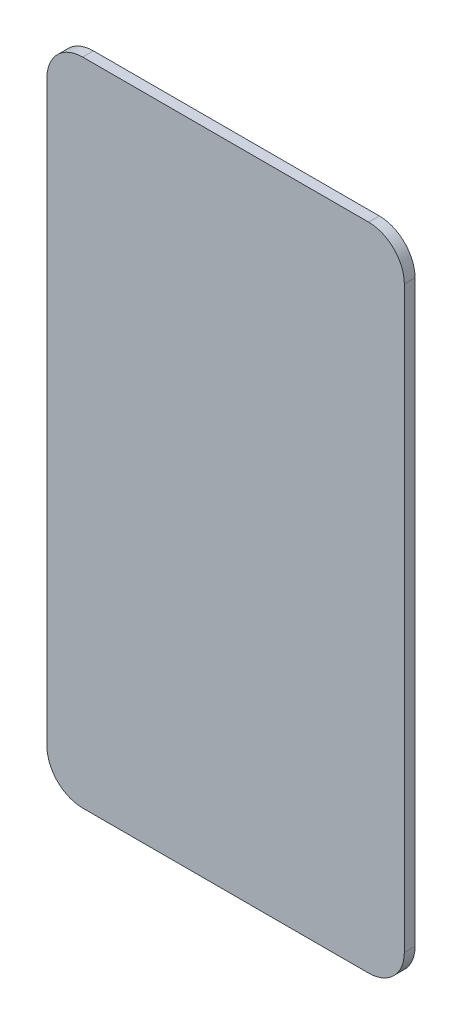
ISO-10303-21;
HEADER;
FILE_DESCRIPTION(('STEP AP214'),'2;1');
FILE_NAME('part.step','',(''),(''),'','','');
FILE_SCHEMA(('AUTOMOTIVE_DESIGN { 1 0 10303 214 1 1 1 1 }'));
ENDSEC;
DATA;
#1=APPLICATION_CONTEXT('core data for automotive mechanical design processes');
#2=APPLICATION_PROTOCOL_DEFINITION('international standard','automotive_design',2000,#1);
#3=PRODUCT_CONTEXT('',#1,'mechanical');
#4=PRODUCT('Part','Part','',(#3));
#5=PRODUCT_RELATED_PRODUCT_CATEGORY('part','',(#4));
#6=PRODUCT_DEFINITION_FORMATION('','',#4);
#7=PRODUCT_DEFINITION_CONTEXT('part definition',#1,'design');
#8=PRODUCT_DEFINITION('design','',#6,#7);
#9=PRODUCT_DEFINITION_SHAPE('','',#8);
#10=(LENGTH_UNIT() NAMED_UNIT(*) SI_UNIT(.MILLI.,.METRE.));
#11=(NAMED_UNIT(*) PLANE_ANGLE_UNIT() SI_UNIT($,.RADIAN.));
#12=(NAMED_UNIT(*) SI_UNIT($,.STERADIAN.) SOLID_ANGLE_UNIT());
#13=UNCERTAINTY_MEASURE_WITH_UNIT(LENGTH_MEASURE(1.E-05),#10,'distance_accuracy_value','');
#14=(GEOMETRIC_REPRESENTATION_CONTEXT(3) GLOBAL_UNCERTAINTY_ASSIGNED_CONTEXT((#13)) GLOBAL_UNIT_ASSIGNED_CONTEXT((#10,
#11,#12)) REPRESENTATION_CONTEXT('',''));
#15=CARTESIAN_POINT('',(0.,0.,0.));
#16=DIRECTION('',(0.,0.,1.));
#17=DIRECTION('',(1.,0.,0.));
#18=AXIS2_PLACEMENT_3D('',#15,#16,#17);
#19=CARTESIAN_POINT('',(-40.,81.,3.));
#20=DIRECTION('',(0.,0.,-1.));
#21=DIRECTION('',(-1.,0.,0.));
#22=AXIS2_PLACEMENT_3D('',#19,#20,#21);
#23=CYLINDRICAL_SURFACE('',#22,9.99999999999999);
#24=CARTESIAN_POINT('',(-40.,81.,0.));
#25=DIRECTION('',(0.,0.,1.));
#26=DIRECTION('',(1.,0.,0.));
#27=AXIS2_PLACEMENT_3D('',#24,#25,#26);
#28=CIRCLE('',#27,9.99999999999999);
#29=CARTESIAN_POINT('',(-39.9999999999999,91.,0.));
#30=VERTEX_POINT('',#29);
#31=CARTESIAN_POINT('',(-50.,80.9999999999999,0.));
#32=VERTEX_POINT('',#31);
#33=EDGE_CURVE('E98',#30,#32,#28,.T.);
#34=ORIENTED_EDGE('',*,*,#33,.T.);
#35=DIRECTION('',(0.,0.,-1.));
#36=VECTOR('',#35,1.);
#37=CARTESIAN_POINT('',(-50.,80.9999999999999,3.));
#38=LINE('',#37,#36);
#39=CARTESIAN_POINT('',(-50.,80.9999999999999,3.));
#40=VERTEX_POINT('',#39);
#41=EDGE_CURVE('E11',#40,#32,#38,.T.);
#42=ORIENTED_EDGE('',*,*,#41,.F.);
#43=CARTESIAN_POINT('',(-40.,81.,3.));
#44=DIRECTION('',(0.,0.,1.));
#45=DIRECTION('',(1.,0.,0.));
#46=AXIS2_PLACEMENT_3D('',#43,#44,#45);
#47=CIRCLE('',#46,9.99999999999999);
#48=CARTESIAN_POINT('',(-39.9999999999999,91.,3.));
#49=VERTEX_POINT('',#48);
#50=EDGE_CURVE('E125',#49,#40,#47,.T.);
#51=ORIENTED_EDGE('',*,*,#50,.F.);
#52=DIRECTION('',(0.,0.,-1.));
#53=VECTOR('',#52,1.);
#54=CARTESIAN_POINT('',(-39.9999999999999,91.,3.));
#55=LINE('',#54,#53);
#56=EDGE_CURVE('E111',#49,#30,#55,.T.);
#57=ORIENTED_EDGE('',*,*,#56,.T.);
#58=EDGE_LOOP('',(#34,#42,#51,#57));
#59=FACE_BOUND('',#58,.T.);
#60=ADVANCED_FACE('F30',(#59),#23,.T.);
#61=CARTESIAN_POINT('',(-50.,80.9999999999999,3.));
#62=DIRECTION('',(1.,0.,0.));
#63=DIRECTION('',(0.,0.,-1.));
#64=AXIS2_PLACEMENT_3D('',#61,#62,#63);
#65=PLANE('',#64);
#66=DIRECTION('',(0.,-1.,0.));
#67=VECTOR('',#66,1.);
#68=CARTESIAN_POINT('',(-50.,80.9999999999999,0.));
#69=LINE('',#68,#67);
#70=CARTESIAN_POINT('',(-50.,-80.9999999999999,0.));
#71=VERTEX_POINT('',#70);
#72=EDGE_CURVE('E94',#32,#71,#69,.T.);
#73=ORIENTED_EDGE('',*,*,#72,.T.);
#74=DIRECTION('',(0.,0.,-1.));
#75=VECTOR('',#74,1.);
#76=CARTESIAN_POINT('',(-50.,-80.9999999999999,3.));
#77=LINE('',#76,#75);
#78=CARTESIAN_POINT('',(-50.,-80.9999999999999,3.));
#79=VERTEX_POINT('',#78);
#80=EDGE_CURVE('E37',#79,#71,#77,.T.);
#81=ORIENTED_EDGE('',*,*,#80,.F.);
#82=DIRECTION('',(0.,-1.,0.));
#83=VECTOR('',#82,1.);
#84=CARTESIAN_POINT('',(-50.,80.9999999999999,3.));
#85=LINE('',#84,#83);
#86=EDGE_CURVE('E107',#40,#79,#85,.T.);
#87=ORIENTED_EDGE('',*,*,#86,.F.);
#88=ORIENTED_EDGE('',*,*,#41,.T.);
#89=EDGE_LOOP('',(#73,#81,#87,#88));
#90=FACE_BOUND('',#89,.T.);
#91=ADVANCED_FACE('F106',(#90),#65,.F.);
#92=CARTESIAN_POINT('',(-40.,-81.,3.));
#93=DIRECTION('',(0.,0.,-1.));
#94=DIRECTION('',(-1.,0.,0.));
#95=AXIS2_PLACEMENT_3D('',#92,#93,#94);
#96=CYLINDRICAL_SURFACE('',#95,9.99999999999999);
#97=CARTESIAN_POINT('',(-40.,-81.,0.));
#98=DIRECTION('',(0.,0.,1.));
#99=DIRECTION('',(-1.,0.,0.));
#100=AXIS2_PLACEMENT_3D('',#97,#98,#99);
#101=CIRCLE('',#100,9.99999999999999);
#102=CARTESIAN_POINT('',(-39.9999999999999,-91.,0.));
#103=VERTEX_POINT('',#102);
#104=EDGE_CURVE('E100',#71,#103,#101,.T.);
#105=ORIENTED_EDGE('',*,*,#104,.T.);
#106=DIRECTION('',(0.,0.,-1.));
#107=VECTOR('',#106,1.);
#108=CARTESIAN_POINT('',(-39.9999999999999,-91.,3.));
#109=LINE('',#108,#107);
#110=CARTESIAN_POINT('',(-39.9999999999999,-91.,3.));
#111=VERTEX_POINT('',#110);
#112=EDGE_CURVE('E151',#111,#103,#109,.T.);
#113=ORIENTED_EDGE('',*,*,#112,.F.);
#114=CARTESIAN_POINT('',(-40.,-81.,3.));
#115=DIRECTION('',(0.,0.,1.));
#116=DIRECTION('',(-1.,0.,0.));
#117=AXIS2_PLACEMENT_3D('',#114,#115,#116);
#118=CIRCLE('',#117,9.99999999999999);
#119=EDGE_CURVE('E128',#79,#111,#118,.T.);
#120=ORIENTED_EDGE('',*,*,#119,.F.);
#121=ORIENTED_EDGE('',*,*,#80,.T.);
#122=EDGE_LOOP('',(#105,#113,#120,#121));
#123=FACE_BOUND('',#122,.T.);
#124=ADVANCED_FACE('F155',(#123),#96,.T.);
#125=CARTESIAN_POINT('',(-39.9999999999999,-91.,3.));
#126=DIRECTION('',(0.,1.,0.));
#127=DIRECTION('',(0.,0.,1.));
#128=AXIS2_PLACEMENT_3D('',#125,#126,#127);
#129=PLANE('',#128);
#130=DIRECTION('',(1.,0.,0.));
#131=VECTOR('',#130,1.);
#132=CARTESIAN_POINT('',(-39.9999999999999,-91.,0.));
#133=LINE('',#132,#131);
#134=CARTESIAN_POINT('',(39.9999999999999,-91.,0.));
#135=VERTEX_POINT('',#134);
#136=EDGE_CURVE('E115',#103,#135,#133,.T.);
#137=ORIENTED_EDGE('',*,*,#136,.T.);
#138=DIRECTION('',(0.,0.,-1.));
#139=VECTOR('',#138,1.);
#140=CARTESIAN_POINT('',(39.9999999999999,-91.,3.));
#141=LINE('',#140,#139);
#142=CARTESIAN_POINT('',(39.9999999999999,-91.,3.));
#143=VERTEX_POINT('',#142);
#144=EDGE_CURVE('E148',#143,#135,#141,.T.);
#145=ORIENTED_EDGE('',*,*,#144,.F.);
#146=DIRECTION('',(1.,0.,0.));
#147=VECTOR('',#146,1.);
#148=CARTESIAN_POINT('',(-39.9999999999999,-91.,3.));
#149=LINE('',#148,#147);
#150=EDGE_CURVE('E130',#111,#143,#149,.T.);
#151=ORIENTED_EDGE('',*,*,#150,.F.);
#152=ORIENTED_EDGE('',*,*,#112,.T.);
#153=EDGE_LOOP('',(#137,#145,#151,#152));
#154=FACE_BOUND('',#153,.T.);
#155=ADVANCED_FACE('F163',(#154),#129,.F.);
#156=CARTESIAN_POINT('',(40.,-81.,3.));
#157=DIRECTION('',(0.,0.,-1.));
#158=DIRECTION('',(-1.,0.,0.));
#159=AXIS2_PLACEMENT_3D('',#156,#157,#158);
#160=CYLINDRICAL_SURFACE('',#159,9.99999999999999);
#161=CARTESIAN_POINT('',(40.,-81.,0.));
#162=DIRECTION('',(0.,0.,1.));
#163=DIRECTION('',(1.,0.,0.));
#164=AXIS2_PLACEMENT_3D('',#161,#162,#163);
#165=CIRCLE('',#164,9.99999999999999);
#166=CARTESIAN_POINT('',(50.,-80.9999999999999,0.));
#167=VERTEX_POINT('',#166);
#168=EDGE_CURVE('E117',#135,#167,#165,.T.);
#169=ORIENTED_EDGE('',*,*,#168,.T.);
#170=DIRECTION('',(0.,0.,-1.));
#171=VECTOR('',#170,1.);
#172=CARTESIAN_POINT('',(50.,-80.9999999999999,3.));
#173=LINE('',#172,#171);
#174=CARTESIAN_POINT('',(50.,-80.9999999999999,3.));
#175=VERTEX_POINT('',#174);
#176=EDGE_CURVE('E145',#175,#167,#173,.T.);
#177=ORIENTED_EDGE('',*,*,#176,.F.);
#178=CARTESIAN_POINT('',(40.,-81.,3.));
#179=DIRECTION('',(0.,0.,1.));
#180=DIRECTION('',(1.,0.,0.));
#181=AXIS2_PLACEMENT_3D('',#178,#179,#180);
#182=CIRCLE('',#181,9.99999999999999);
#183=EDGE_CURVE('E132',#143,#175,#182,.T.);
#184=ORIENTED_EDGE('',*,*,#183,.F.);
#185=ORIENTED_EDGE('',*,*,#144,.T.);
#186=EDGE_LOOP('',(#169,#177,#184,#185));
#187=FACE_BOUND('',#186,.T.);
#188=ADVANCED_FACE('F166',(#187),#160,.T.);
#189=CARTESIAN_POINT('',(50.,80.9999999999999,3.));
#190=DIRECTION('',(-1.,0.,0.));
#191=DIRECTION('',(0.,0.,1.));
#192=AXIS2_PLACEMENT_3D('',#189,#190,#191);
#193=PLANE('',#192);
#194=DIRECTION('',(0.,1.,0.));
#195=VECTOR('',#194,1.);
#196=CARTESIAN_POINT('',(50.,80.9999999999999,0.));
#197=LINE('',#196,#195);
#198=CARTESIAN_POINT('',(50.,80.9999999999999,0.));
#199=VERTEX_POINT('',#198);
#200=EDGE_CURVE('E119',#167,#199,#197,.T.);
#201=ORIENTED_EDGE('',*,*,#200,.T.);
#202=DIRECTION('',(0.,0.,-1.));
#203=VECTOR('',#202,1.);
#204=CARTESIAN_POINT('',(50.,80.9999999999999,3.));
#205=LINE('',#204,#203);
#206=CARTESIAN_POINT('',(50.,80.9999999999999,3.));
#207=VERTEX_POINT('',#206);
#208=EDGE_CURVE('E142',#207,#199,#205,.T.);
#209=ORIENTED_EDGE('',*,*,#208,.F.);
#210=DIRECTION('',(0.,1.,0.));
#211=VECTOR('',#210,1.);
#212=CARTESIAN_POINT('',(50.,80.9999999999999,3.));
#213=LINE('',#212,#211);
#214=EDGE_CURVE('E134',#175,#207,#213,.T.);
#215=ORIENTED_EDGE('',*,*,#214,.F.);
#216=ORIENTED_EDGE('',*,*,#176,.T.);
#217=EDGE_LOOP('',(#201,#209,#215,#216));
#218=FACE_BOUND('',#217,.T.);
#219=ADVANCED_FACE('F171',(#218),#193,.F.);
#220=CARTESIAN_POINT('',(40.,81.,3.));
#221=DIRECTION('',(0.,0.,-1.));
#222=DIRECTION('',(-1.,0.,0.));
#223=AXIS2_PLACEMENT_3D('',#220,#221,#222);
#224=CYLINDRICAL_SURFACE('',#223,9.99999999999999);
#225=CARTESIAN_POINT('',(40.,81.,0.));
#226=DIRECTION('',(0.,0.,1.));
#227=DIRECTION('',(1.,0.,0.));
#228=AXIS2_PLACEMENT_3D('',#225,#226,#227);
#229=CIRCLE('',#228,9.99999999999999);
#230=CARTESIAN_POINT('',(39.9999999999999,91.,0.));
#231=VERTEX_POINT('',#230);
#232=EDGE_CURVE('E121',#199,#231,#229,.T.);
#233=ORIENTED_EDGE('',*,*,#232,.T.);
#234=DIRECTION('',(0.,0.,-1.));
#235=VECTOR('',#234,1.);
#236=CARTESIAN_POINT('',(39.9999999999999,91.,3.));
#237=LINE('',#236,#235);
#238=CARTESIAN_POINT('',(39.9999999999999,91.,3.));
#239=VERTEX_POINT('',#238);
#240=EDGE_CURVE('E139',#239,#231,#237,.T.);
#241=ORIENTED_EDGE('',*,*,#240,.F.);
#242=CARTESIAN_POINT('',(40.,81.,3.));
#243=DIRECTION('',(0.,0.,1.));
#244=DIRECTION('',(1.,0.,0.));
#245=AXIS2_PLACEMENT_3D('',#242,#243,#244);
#246=CIRCLE('',#245,9.99999999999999);
#247=EDGE_CURVE('E49',#207,#239,#246,.T.);
#248=ORIENTED_EDGE('',*,*,#247,.F.);
#249=ORIENTED_EDGE('',*,*,#208,.T.);
#250=EDGE_LOOP('',(#233,#241,#248,#249));
#251=FACE_BOUND('',#250,.T.);
#252=ADVANCED_FACE('F174',(#251),#224,.T.);
#253=CARTESIAN_POINT('',(-39.9999999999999,91.,3.));
#254=DIRECTION('',(0.,-1.,0.));
#255=DIRECTION('',(0.,0.,-1.));
#256=AXIS2_PLACEMENT_3D('',#253,#254,#255);
#257=PLANE('',#256);
#258=DIRECTION('',(-1.,0.,0.));
#259=VECTOR('',#258,1.);
#260=CARTESIAN_POINT('',(-39.9999999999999,91.,0.));
#261=LINE('',#260,#259);
#262=EDGE_CURVE('E123',#231,#30,#261,.T.);
#263=ORIENTED_EDGE('',*,*,#262,.T.);
#264=ORIENTED_EDGE('',*,*,#56,.F.);
#265=DIRECTION('',(-1.,0.,0.));
#266=VECTOR('',#265,1.);
#267=CARTESIAN_POINT('',(-39.9999999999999,91.,3.));
#268=LINE('',#267,#266);
#269=EDGE_CURVE('E44',#239,#49,#268,.T.);
#270=ORIENTED_EDGE('',*,*,#269,.F.);
#271=ORIENTED_EDGE('',*,*,#240,.T.);
#272=EDGE_LOOP('',(#263,#264,#270,#271));
#273=FACE_BOUND('',#272,.T.);
#274=ADVANCED_FACE('F176',(#273),#257,.F.);
#275=CARTESIAN_POINT('',(-40.,81.,3.));
#276=DIRECTION('',(0.,0.,1.));
#277=DIRECTION('',(1.,0.,0.));
#278=AXIS2_PLACEMENT_3D('',#275,#276,#277);
#279=PLANE('',#278);
#280=ORIENTED_EDGE('',*,*,#50,.T.);
#281=ORIENTED_EDGE('',*,*,#86,.T.);
#282=ORIENTED_EDGE('',*,*,#119,.T.);
#283=ORIENTED_EDGE('',*,*,#150,.T.);
#284=ORIENTED_EDGE('',*,*,#183,.T.);
#285=ORIENTED_EDGE('',*,*,#214,.T.);
#286=ORIENTED_EDGE('',*,*,#247,.T.);
#287=ORIENTED_EDGE('',*,*,#269,.T.);
#288=EDGE_LOOP('',(#280,#281,#282,#283,#284,#285,#286,#287));
#289=FACE_BOUND('',#288,.T.);
#290=ADVANCED_FACE('F158',(#289),#279,.T.);
#291=CARTESIAN_POINT('',(-40.,81.,0.));
#292=DIRECTION('',(0.,0.,1.));
#293=DIRECTION('',(1.,0.,0.));
#294=AXIS2_PLACEMENT_3D('',#291,#292,#293);
#295=PLANE('',#294);
#296=ORIENTED_EDGE('',*,*,#33,.F.);
#297=ORIENTED_EDGE('',*,*,#262,.F.);
#298=ORIENTED_EDGE('',*,*,#232,.F.);
#299=ORIENTED_EDGE('',*,*,#200,.F.);
#300=ORIENTED_EDGE('',*,*,#168,.F.);
#301=ORIENTED_EDGE('',*,*,#136,.F.);
#302=ORIENTED_EDGE('',*,*,#104,.F.);
#303=ORIENTED_EDGE('',*,*,#72,.F.);
#304=EDGE_LOOP('',(#296,#297,#298,#299,#300,#301,#302,#303));
#305=FACE_BOUND('',#304,.T.);
#306=ADVANCED_FACE('F95',(#305),#295,.F.);
#307=CLOSED_SHELL('',(#60,#91,#124,#155,#188,#219,#252,#274,#290,#306));
#308=MANIFOLD_SOLID_BREP('B2',#307);
#309=ADVANCED_BREP_SHAPE_REPRESENTATION('',(#18,#308),#14);
#310=SHAPE_DEFINITION_REPRESENTATION(#9,#309);
ENDSEC;
END-ISO-10303-21;
